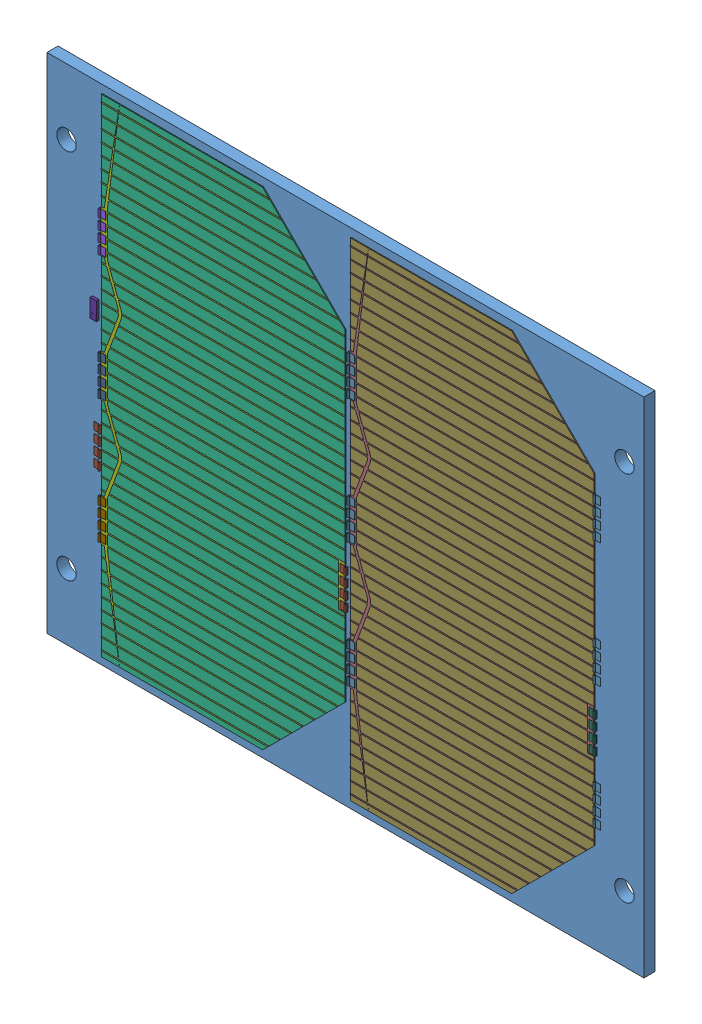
SolidWorks assembly P110UB.SLDASM, configuration Default (file format 7000). Lengths in mm.
Overall size (98 82.6 7.77).
46 component instances, 19 part files, 0 mates.
Components (placement in the parent):
- Board_1-1: Board_1.sldprt [Default] at (0 0 -1.8134) size (98 82.6 1.83)
- S2_1-1: S2_1.sldasm [Default] at origin size (4.2 10.15 4.7)
  - 533980471_1-1: 533980471_1.sldasm [Default] at (16.2 -22.1 -4.1634) x (0 -1 0) z (0 0 -1) size (10.15 4.2 4.7)
    - Open CASCADE STEP translator 6.2 7.2.1.1-1: Open CASCADE STEP translator 6.2 7.2.1.1.sldprt [Default] at origin size (10.15 4.2 4.7)
- C2_1-1: C2_1.sldasm [Default] at origin size (0.95 1.75 0.85)
  - 421952544_1-1: 421952544_1.sldasm [Default] at (14.4 -35.25 -2.6634) size (0.95 1.75 0.85)
    - Extruded_1-1: Extruded_1.sldprt [Default] at origin size (0.95 1.75 0.85)
- C1_1-1: C1_1.sldasm [Default] at origin size (1.75 0.95 0.85)
  - 421952672_1-1: 421952672_1.sldasm [Default] at (14.3 -49.25 -2.6634) size (1.75 0.95 0.85)
    - Extruded_1_2-1: Extruded_1_2.sldprt [Default] at origin size (1.75 0.95 0.85)
- U1_1-1: U1_1.sldasm [Default] at origin size (3.2 3.2 1.09)
  - 421952416_1-1: 421952416_1.sldasm [Default] at (16.5 -34.5 -2.9034) size (3.2 3.2 1.09)
    - Extruded_1_3-1: Extruded_1_3.sldprt [Default] at origin size (3.2 3.2 1.09)
- PV5_1-1: PV5_1.sldasm [Default] at origin size (47.92 80 0.47)
  - 3G30C-cathode_1-1: 3G30C-cathode_1.sldasm [Default] at (32.867 -21.3 0.0227) x (0 -1 0) z (0 0 1) size (80 47.92 0.47)
    - 3G28-base_1-1: 3G28-base_1.sldprt [Default] at origin size (80 40 0.15)
    - 3G30C_1-1: 3G30C_1.sldprt [Default] at (-2.952 -0.0367 0.15) size (80 40 0.01)
    - covar-tab_4-1: covar-tab_4.sldprt [Default] at (2.825 -23.042 0.16) x (0 -1 0) z (-1 0 0) size (1.9 0.46 6.5)
    - covar-tab_1_1-1: covar-tab_1_1.sldprt [Default] at (43.675 -23.042 0.16) x (0 -1 0) z (-1 0 0) size (1.9 0.46 6.5)
    - covar-tab_2_1-1: covar-tab_2_1.sldprt [Default] at (23.25 -23.042 0.16) x (0 -1 0) z (-1 0 0) size (1.9 0.46 6.5)
    - covar-tab_4_2-1: covar-tab_4_2.sldprt [Default] at (27.075 15.448 0.16) x (0 1 0) z (1 0 0) size (7.53 0.46 6.5)
    - covar-tab_4_2-2: covar-tab_4_2.sldprt [Default] at (27.075 -24.942 0.175) x (0 1 0) z (1 0 0) size (7.53 0.46 6.5)
- PV4_1-1: PV4_1.sldasm [Default] at origin size (47.92 80 0.47)
  - 3G30C-anode_1-1: 3G30C-anode_1.sldasm [Default] at (73.747 -21.3 0.0227) x (0 -1 0) z (0 0 1) size (80 47.92 0.47)
    - 3G28-base_1_2-1: 3G28-base_1_2.sldprt [Default] at origin size (80 40 0.15)
    - 3G30C_1_2-1: 3G30C_1_2.sldprt [Default] at (-2.952 -0.0367 0.15) size (80 40 0.01)
    - covar-tab_4_3-1: covar-tab_4_3.sldprt [Default] at (2.825 -23.042 0.16) x (0 -1 0) z (-1 0 0) size (7.53 0.46 6.5)
    - covar-tab_4_3-2: covar-tab_4_3.sldprt [Default] at (43.675 -23.042 0.16) x (0 -1 0) z (-1 0 0) size (7.53 0.46 6.5)
    - covar-tab_4_3-3: covar-tab_4_3.sldprt [Default] at (23.25 -23.042 0.16) x (0 -1 0) z (-1 0 0) size (7.53 0.46 6.5)
    - covar-tab_1_1_2-1: covar-tab_1_1_2.sldprt [Default] at (27.075 15.448 0.16) x (0 1 0) z (1 0 0) size (1.9 0.46 6.5)
    - covar-tab_4_3-4: covar-tab_4_3.sldprt [Default] at (2.825 17.348 0.175) x (0 -1 0) z (-1 0 0) size (7.53 0.46 6.5)
    - covar-tab_4_3-5: covar-tab_4_3.sldprt [Default] at (23.25 17.348 0.175) x (0 -1 0) z (-1 0 0) size (7.53 0.46 6.5)
    - covar-tab_4_3-6: covar-tab_4_3.sldprt [Default] at (43.675 17.348 0.175) x (0 -1 0) z (-1 0 0) size (7.53 0.46 6.5)
- D3_1-1: D3_1.sldasm [Default] at origin size (5.1 6.9 0.7)
  - 421952288_1-1: 421952288_1.sldasm [Default] at (23.3 -20.9 -2.5134) size (5.1 6.9 0.7)
    - Extruded_1_4-1: Extruded_1_4.sldprt [Default] at origin size (5.1 6.9 0.7)
- D1_1-1: D1_1.sldasm [Default] at origin size (1 3 0.41)
  - sunsensor_1-1: sunsensor_1.sldprt [Default] at (8.3425 -49.0551 0.0127) x (0 -1 0) z (0 0 1) size (3 1 0.41)
- H2_1-1: H2_1.sldasm [Default] at origin size (4.2 20.15 4.7)
  - 533981271_1-1: 533981271_1.sldasm [Default] at (10.85 -38.375 -4.1634) x (0 -1 0) z (0 0 -1) size (20.15 4.2 4.7)
    - Open CASCADE STEP translator 6.2 7.10.1.1-1: Open CASCADE STEP translator 6.2 7.10.1.1.sldprt [Default] at origin size (20.15 4.2 4.7)
- Imported_1-1: Imported_1.sldasm [Default] at origin size (4.2 10.15 4.7)
  - 533980471_1-1: 533980471_1.sldasm [Default] at (10.95 -22.1 -4.1634) x (0 -1 0) z (0 0 -1) size (10.15 4.2 4.7)
    - Open CASCADE STEP translator 6.2 7.2.1.1-1: Open CASCADE STEP translator 6.2 7.2.1.1.sldprt [Default] at origin size (10.15 4.2 4.7)
- U2_1-1: U2_1.sldasm [Default] at origin size (11 11 5.5)
  - adis16251_1-1: adis16251_1.sldprt [Default] at (-2.5187 -64.3051 -1.8134) x (-1 0 0) z (0 0 -1) size (11 11 5.5)
